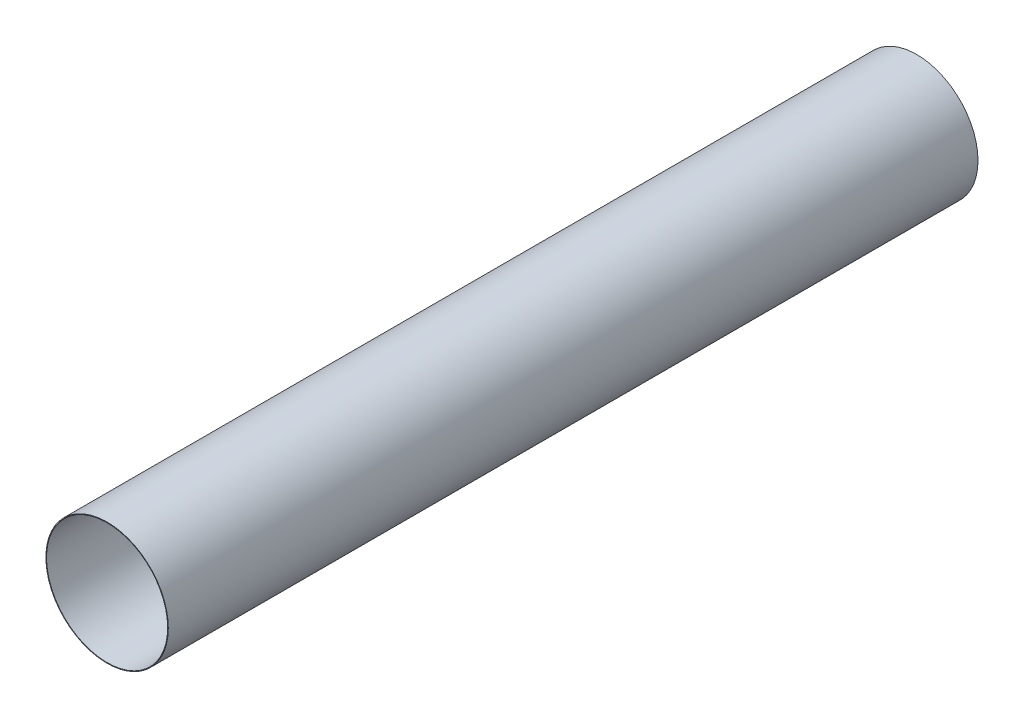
from build123d import *

# Parameters (mm, degrees)
SKETCH1_R           = 19.2
SKETCH1_R_2         = 19
BOSS_EXTRUDE1_DEPTH = 254


with BuildPart() as part:
    # Sketch1 → Boss-Extrude1 (new body)
    with BuildSketch(Plane.XY):
        Circle(SKETCH1_R)
        Circle(SKETCH1_R_2, mode=Mode.SUBTRACT)
    extrude(amount=-BOSS_EXTRUDE1_DEPTH)


solid = part.part
